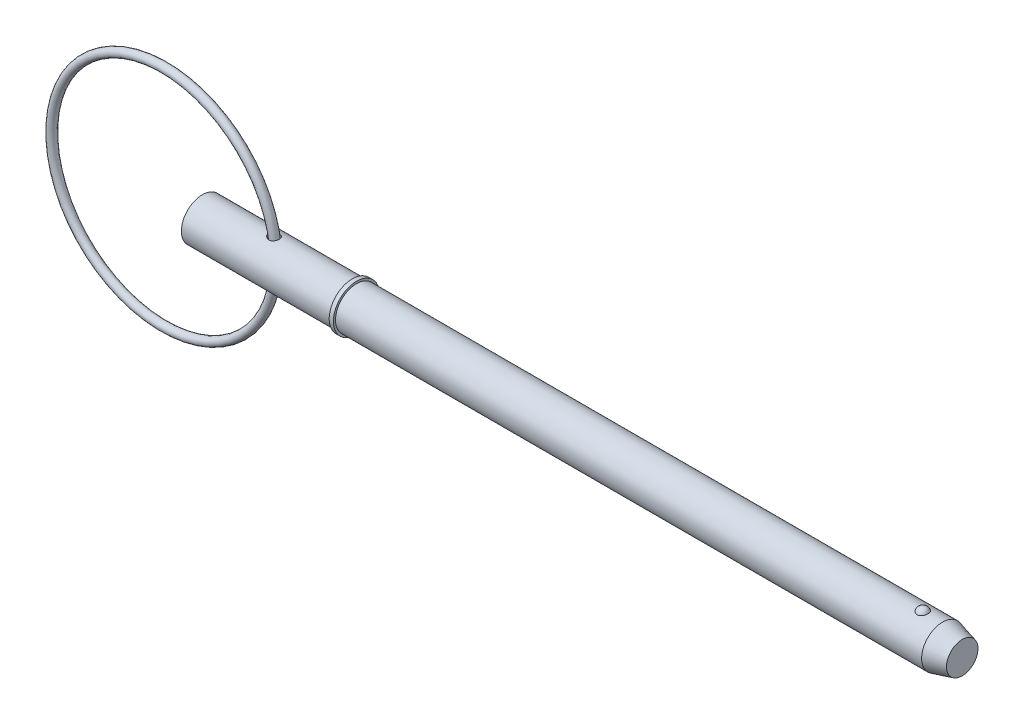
ISO-10303-21;
HEADER;
FILE_DESCRIPTION(('STEP AP214'),'2;1');
FILE_NAME('part.step','',(''),(''),'','','');
FILE_SCHEMA(('AUTOMOTIVE_DESIGN { 1 0 10303 214 1 1 1 1 }'));
ENDSEC;
DATA;
#1=APPLICATION_CONTEXT('core data for automotive mechanical design processes');
#2=APPLICATION_PROTOCOL_DEFINITION('international standard','automotive_design',2000,#1);
#3=PRODUCT_CONTEXT('',#1,'mechanical');
#4=PRODUCT('Part','Part','',(#3));
#5=PRODUCT_RELATED_PRODUCT_CATEGORY('part','',(#4));
#6=PRODUCT_DEFINITION_FORMATION('','',#4);
#7=PRODUCT_DEFINITION_CONTEXT('part definition',#1,'design');
#8=PRODUCT_DEFINITION('design','',#6,#7);
#9=PRODUCT_DEFINITION_SHAPE('','',#8);
#10=(LENGTH_UNIT() NAMED_UNIT(*) SI_UNIT(.MILLI.,.METRE.));
#11=(NAMED_UNIT(*) PLANE_ANGLE_UNIT() SI_UNIT($,.RADIAN.));
#12=(NAMED_UNIT(*) SI_UNIT($,.STERADIAN.) SOLID_ANGLE_UNIT());
#13=UNCERTAINTY_MEASURE_WITH_UNIT(LENGTH_MEASURE(1.E-05),#10,'distance_accuracy_value','');
#14=(GEOMETRIC_REPRESENTATION_CONTEXT(3) GLOBAL_UNCERTAINTY_ASSIGNED_CONTEXT((#13)) GLOBAL_UNIT_ASSIGNED_CONTEXT((#10,
#11,#12)) REPRESENTATION_CONTEXT('',''));
#15=CARTESIAN_POINT('',(0.,0.,0.));
#16=DIRECTION('',(0.,0.,1.));
#17=DIRECTION('',(1.,0.,0.));
#18=AXIS2_PLACEMENT_3D('',#15,#16,#17);
#19=CARTESIAN_POINT('',(-4.3552379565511,0.,0.));
#20=DIRECTION('',(0.,0.,1.));
#21=DIRECTION('',(1.,0.,0.));
#22=AXIS2_PLACEMENT_3D('',#19,#20,#21);
#23=TOROIDAL_SURFACE('',#22,12.7,0.476000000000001);
#24=CARTESIAN_POINT('',(8.8207620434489,0.,0.));
#25=VERTEX_POINT('',#24);
#26=VERTEX_LOOP('',#25);
#27=FACE_BOUND('',#26,.T.);
#28=ADVANCED_FACE('P0_F12',(#27),#23,.T.);
#29=CLOSED_SHELL('',(#28));
#30=MANIFOLD_SOLID_BREP('P0_B1',#29);
#31=CARTESIAN_POINT('',(0.,0.,0.));
#32=DIRECTION('',(1.,0.,0.));
#33=DIRECTION('',(0.,0.,-1.));
#34=AXIS2_PLACEMENT_3D('',#31,#32,#33);
#35=CYLINDRICAL_SURFACE('',#34,2.38);
#36=CARTESIAN_POINT('',(7.65248265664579,2.35074198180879,-0.372037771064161));
#37=CARTESIAN_POINT('',(7.67546616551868,2.34644965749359,-0.399158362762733));
#38=CARTESIAN_POINT('',(7.70081651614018,2.34199234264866,-0.424274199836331));
#39=CARTESIAN_POINT('',(7.75542747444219,2.33326580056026,-0.46990771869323));
#40=CARTESIAN_POINT('',(7.78469342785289,2.32899684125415,-0.49041900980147));
#41=CARTESIAN_POINT('',(7.8462833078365,2.32114904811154,-0.526312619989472));
#42=CARTESIAN_POINT('',(7.87860537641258,2.31756979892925,-0.541698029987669));
#43=CARTESIAN_POINT('',(7.9454452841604,2.31153734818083,-0.566889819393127));
#44=CARTESIAN_POINT('',(7.97996214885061,2.30908365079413,-0.576698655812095));
#45=CARTESIAN_POINT('',(8.05000735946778,2.30564492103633,-0.590297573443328));
#46=CARTESIAN_POINT('',(8.0855275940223,2.30465036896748,-0.594126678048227));
#47=CARTESIAN_POINT('',(8.15670718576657,2.30426876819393,-0.595606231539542));
#48=CARTESIAN_POINT('',(8.1923664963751,2.30488122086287,-0.593258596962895));
#49=CARTESIAN_POINT('',(8.26077822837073,2.30759475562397,-0.582609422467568));
#50=CARTESIAN_POINT('',(8.29358437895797,2.30961492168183,-0.574631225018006));
#51=CARTESIAN_POINT('',(8.35727060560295,2.31483318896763,-0.553233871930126));
#52=CARTESIAN_POINT('',(8.38815097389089,2.31803111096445,-0.53981554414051));
#53=CARTESIAN_POINT('',(8.44618254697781,2.3251225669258,-0.508384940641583));
#54=CARTESIAN_POINT('',(8.47341743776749,2.32899254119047,-0.490521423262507));
#55=CARTESIAN_POINT('',(8.5244826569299,2.33706025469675,-0.450515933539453));
#56=CARTESIAN_POINT('',(8.54831285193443,2.34125800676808,-0.428373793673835));
#57=CARTESIAN_POINT('',(8.5921621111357,2.34956202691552,-0.38020980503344));
#58=CARTESIAN_POINT('',(8.61214543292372,2.35366715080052,-0.354155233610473));
#59=CARTESIAN_POINT('',(8.64754725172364,2.36130301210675,-0.299034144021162));
#60=CARTESIAN_POINT('',(8.66296545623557,2.36483371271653,-0.269967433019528));
#61=CARTESIAN_POINT('',(8.68903776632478,2.37098548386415,-0.209215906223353));
#62=CARTESIAN_POINT('',(8.69962580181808,2.37359383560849,-0.177501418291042));
#63=CARTESIAN_POINT('',(8.71546966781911,2.37755210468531,-0.112692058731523));
#64=CARTESIAN_POINT('',(8.72072552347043,2.37890202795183,-0.0795971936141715));
#65=CARTESIAN_POINT('',(8.72577448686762,2.38019811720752,-0.0129544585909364));
#66=CARTESIAN_POINT('',(8.72556573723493,2.38014380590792,0.0205935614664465));
#67=CARTESIAN_POINT('',(8.71968604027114,2.37863606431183,0.0871753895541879));
#68=CARTESIAN_POINT('',(8.71401506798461,2.37718262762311,0.120209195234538));
#69=CARTESIAN_POINT('',(8.69736472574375,2.37303648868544,0.184779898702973));
#70=CARTESIAN_POINT('',(8.68639268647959,2.37034549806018,0.216318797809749));
#71=CARTESIAN_POINT('',(8.65941400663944,2.36401552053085,0.277063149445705));
#72=CARTESIAN_POINT('',(8.6434071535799,2.36037649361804,0.306268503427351));
#73=CARTESIAN_POINT('',(8.60670627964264,2.35253749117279,0.361595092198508));
#74=CARTESIAN_POINT('',(8.58600040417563,2.34833610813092,0.387708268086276));
#75=CARTESIAN_POINT('',(8.54044852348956,2.33984863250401,0.436017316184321));
#76=CARTESIAN_POINT('',(8.51560272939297,2.33556254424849,0.458213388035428));
#77=CARTESIAN_POINT('',(8.46260111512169,2.32742099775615,0.497916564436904));
#78=CARTESIAN_POINT('',(8.43446763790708,2.32356294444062,0.51545294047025));
#79=CARTESIAN_POINT('',(8.37555109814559,2.31668866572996,0.545520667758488));
#80=CARTESIAN_POINT('',(8.34476845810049,2.31367230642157,0.558052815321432));
#81=CARTESIAN_POINT('',(8.28194930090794,2.30886128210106,0.57763341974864));
#82=CARTESIAN_POINT('',(8.24993988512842,2.30704826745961,0.584764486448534));
#83=CARTESIAN_POINT('',(8.18514558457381,2.30475365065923,0.593744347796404));
#84=CARTESIAN_POINT('',(8.15236068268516,2.30427207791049,0.595593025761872));
#85=CARTESIAN_POINT('',(8.08670515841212,2.30466513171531,0.594069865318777));
#86=CARTESIAN_POINT('',(8.05383545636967,2.30554895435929,0.590662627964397));
#87=CARTESIAN_POINT('',(7.98908593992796,2.30856010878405,0.578780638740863));
#88=CARTESIAN_POINT('',(7.95720636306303,2.31068773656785,0.570304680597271));
#89=CARTESIAN_POINT('',(7.89377258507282,2.31605973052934,0.54809064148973));
#90=CARTESIAN_POINT('',(7.86230095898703,2.31935100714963,0.534128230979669));
#91=CARTESIAN_POINT('',(7.80205133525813,2.32664713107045,0.501391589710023));
#92=CARTESIAN_POINT('',(7.77327429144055,2.33065222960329,0.48261566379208));
#93=CARTESIAN_POINT('',(7.7179634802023,2.3391254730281,0.439760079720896));
#94=CARTESIAN_POINT('',(7.69158313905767,2.3436062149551,0.415484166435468));
#95=CARTESIAN_POINT('',(7.64339516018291,2.35235146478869,0.362706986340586));
#96=CARTESIAN_POINT('',(7.62158727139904,2.35661598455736,0.334205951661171));
#97=CARTESIAN_POINT('',(7.58382605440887,2.36432007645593,0.274368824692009));
#98=CARTESIAN_POINT('',(7.56774982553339,2.36777633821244,0.243112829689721));
#99=CARTESIAN_POINT('',(7.54152169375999,2.3735493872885,0.178112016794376));
#100=CARTESIAN_POINT('',(7.53136536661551,2.3758670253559,0.14436907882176));
#101=CARTESIAN_POINT('',(7.51809691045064,2.37891982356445,0.0783638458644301));
#102=CARTESIAN_POINT('',(7.5144720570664,2.37976992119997,0.0462095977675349));
#103=CARTESIAN_POINT('',(7.51285288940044,2.38014795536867,-0.0182487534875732));
#104=CARTESIAN_POINT('',(7.5148575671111,2.37967612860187,-0.0505528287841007));
#105=CARTESIAN_POINT('',(7.52413867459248,2.37752661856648,-0.112617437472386));
#106=CARTESIAN_POINT('',(7.53113538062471,2.37591295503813,-0.14242285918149));
#107=CARTESIAN_POINT('',(7.5497775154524,2.37172196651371,-0.200451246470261));
#108=CARTESIAN_POINT('',(7.56142049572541,2.3691451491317,-0.228675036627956));
#109=CARTESIAN_POINT('',(7.58571901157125,2.36396321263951,-0.276620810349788));
#110=CARTESIAN_POINT('',(7.59751818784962,2.36150235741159,-0.296799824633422));
#111=CARTESIAN_POINT('',(7.62336661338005,2.35629864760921,-0.33561908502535));
#112=CARTESIAN_POINT('',(7.63741608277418,2.353555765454,-0.354259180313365));
#113=CARTESIAN_POINT('',(7.65248265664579,2.35074198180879,-0.372037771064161));
#114=B_SPLINE_CURVE_WITH_KNOTS('',3,(#36,#37,#38,#39,#40,#41,#42,#43,#44,#45,#46,#47,#48,#49,
#50,#51,#52,#53,#54,#55,#56,#57,#58,#59,#60,#61,#62,#63,#64,#65,#66,#67,#68,#69,#70,#71,#72,#73,
#74,#75,#76,#77,#78,#79,#80,#81,#82,#83,#84,#85,#86,#87,#88,#89,#90,#91,#92,#93,#94,#95,#96,#97,
#98,#99,#100,#101,#102,#103,#104,#105,#106,#107,#108,#109,#110,#111,#112,#113),.UNSPECIFIED.,
.T.,.F.,(4,2,2,2,2,2,2,2,2,2,2,2,2,2,2,2,2,2,2,2,2,2,2,2,2,2,2,2,2,2,2,2,2,2,2,2,2,2,4),(0.,
0.107335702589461,0.214819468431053,0.322238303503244,0.429609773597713,0.536277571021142,
0.642912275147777,0.743874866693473,0.844822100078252,0.942762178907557,1.04070609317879,
1.1395202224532,1.23834068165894,1.33847507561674,1.43860899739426,1.53877695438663,
1.63894536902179,1.73897565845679,1.83901017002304,1.93929990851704,2.03958453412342,
2.13922343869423,2.23884648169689,2.33691317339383,2.4349820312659,2.53371427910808,
2.63247003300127,2.73577311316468,2.83911262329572,2.94697761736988,3.05483668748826,
3.16021984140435,3.26552413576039,3.36212700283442,3.45871257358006,3.55027266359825,
3.64178456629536,3.71214035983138,3.78250304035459),.UNSPECIFIED.);
#115=CARTESIAN_POINT('',(7.65248265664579,2.35074198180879,-0.372037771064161));
#116=VERTEX_POINT('',#115);
#117=EDGE_CURVE('P1_E42',#116,#116,#114,.T.);
#118=ORIENTED_EDGE('',*,*,#117,.T.);
#119=EDGE_LOOP('',(#118));
#120=FACE_BOUND('',#119,.T.);
#121=CARTESIAN_POINT('',(0.,0.,0.));
#122=DIRECTION('',(1.,0.,0.));
#123=DIRECTION('',(0.,0.,-1.));
#124=AXIS2_PLACEMENT_3D('',#121,#122,#123);
#125=CIRCLE('',#124,2.38);
#126=CARTESIAN_POINT('',(0.,0.,-2.38));
#127=VERTEX_POINT('',#126);
#128=EDGE_CURVE('P1_E9',#127,#127,#125,.T.);
#129=ORIENTED_EDGE('',*,*,#128,.T.);
#130=EDGE_LOOP('',(#129));
#131=FACE_BOUND('',#130,.T.);
#132=CARTESIAN_POINT('',(16.974,0.,0.));
#133=DIRECTION('',(1.,0.,0.));
#134=DIRECTION('',(0.,0.,-1.));
#135=AXIS2_PLACEMENT_3D('',#132,#133,#134);
#136=CIRCLE('',#135,2.38);
#137=CARTESIAN_POINT('',(16.974,0.,-2.38));
#138=VERTEX_POINT('',#137);
#139=EDGE_CURVE('P1_E25',#138,#138,#136,.T.);
#140=ORIENTED_EDGE('',*,*,#139,.F.);
#141=EDGE_LOOP('',(#140));
#142=FACE_BOUND('',#141,.T.);
#143=CARTESIAN_POINT('',(7.65248265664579,-2.35074198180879,-0.372037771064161));
#144=CARTESIAN_POINT('',(7.63152023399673,-2.35465684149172,-0.347300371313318));
#145=CARTESIAN_POINT('',(7.61251328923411,-2.35843676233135,-0.320880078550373));
#146=CARTESIAN_POINT('',(7.57904107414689,-2.36534227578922,-0.265218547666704));
#147=CARTESIAN_POINT('',(7.56457485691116,-2.36846800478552,-0.235977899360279));
#148=CARTESIAN_POINT('',(7.54072865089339,-2.37373250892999,-0.175281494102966));
#149=CARTESIAN_POINT('',(7.53136565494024,-2.37586798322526,-0.143818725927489));
#150=CARTESIAN_POINT('',(7.51825775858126,-2.37888184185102,-0.0796854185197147));
#151=CARTESIAN_POINT('',(7.51451093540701,-2.37976065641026,-0.0470152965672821));
#152=CARTESIAN_POINT('',(7.51287230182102,-2.38014359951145,0.0167788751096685));
#153=CARTESIAN_POINT('',(7.51468714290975,-2.37971660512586,0.0478953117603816));
#154=CARTESIAN_POINT('',(7.52344977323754,-2.37768530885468,0.109352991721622));
#155=CARTESIAN_POINT('',(7.53039746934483,-2.37608102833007,0.139694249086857));
#156=CARTESIAN_POINT('',(7.54900783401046,-2.37189301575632,0.198451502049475));
#157=CARTESIAN_POINT('',(7.56061918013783,-2.36931996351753,0.226884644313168));
#158=CARTESIAN_POINT('',(7.58810377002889,-2.36345094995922,0.281524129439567));
#159=CARTESIAN_POINT('',(7.60397804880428,-2.36015481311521,0.307729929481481));
#160=CARTESIAN_POINT('',(7.64062367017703,-2.35291979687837,0.359001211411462));
#161=CARTESIAN_POINT('',(7.66164499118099,-2.34895316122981,0.383883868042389));
#162=CARTESIAN_POINT('',(7.70730875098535,-2.34094029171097,0.430056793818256));
#163=CARTESIAN_POINT('',(7.73195270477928,-2.33689402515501,0.451345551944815));
#164=CARTESIAN_POINT('',(7.78628123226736,-2.32880869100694,0.491427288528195));
#165=CARTESIAN_POINT('',(7.81620889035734,-2.32479472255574,0.509896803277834));
#166=CARTESIAN_POINT('',(7.87876464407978,-2.31758417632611,0.541729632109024));
#167=CARTESIAN_POINT('',(7.91139323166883,-2.31438774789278,0.55509201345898));
#168=CARTESIAN_POINT('',(7.97916670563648,-2.30915137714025,0.576493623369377));
#169=CARTESIAN_POINT('',(8.0143485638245,-2.30713552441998,0.584422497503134));
#170=CARTESIAN_POINT('',(8.08560438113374,-2.30465258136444,0.594140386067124));
#171=CARTESIAN_POINT('',(8.12167802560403,-2.30418495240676,0.595931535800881));
#172=CARTESIAN_POINT('',(8.19193481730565,-2.30488473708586,0.59321801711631));
#173=CARTESIAN_POINT('',(8.2261295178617,-2.30597897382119,0.588995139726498));
#174=CARTESIAN_POINT('',(8.29321509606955,-2.30956729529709,0.574762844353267));
#175=CARTESIAN_POINT('',(8.32610629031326,-2.31206103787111,0.564754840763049));
#176=CARTESIAN_POINT('',(8.38816900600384,-2.31802118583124,0.539753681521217));
#177=CARTESIAN_POINT('',(8.41743993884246,-2.32144077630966,0.52499526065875));
#178=CARTESIAN_POINT('',(8.47302365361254,-2.32890801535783,0.490807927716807));
#179=CARTESIAN_POINT('',(8.49933643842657,-2.33295566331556,0.471379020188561));
#180=CARTESIAN_POINT('',(8.54827790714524,-2.3412242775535,0.428422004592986));
#181=CARTESIAN_POINT('',(8.57091094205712,-2.34544503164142,0.40489880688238));
#182=CARTESIAN_POINT('',(8.61197038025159,-2.35360640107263,0.354387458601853));
#183=CARTESIAN_POINT('',(8.63039647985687,-2.35754699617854,0.32739905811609));
#184=CARTESIAN_POINT('',(8.66284943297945,-2.36478461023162,0.270249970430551));
#185=CARTESIAN_POINT('',(8.67680333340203,-2.36807065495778,0.240046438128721));
#186=CARTESIAN_POINT('',(8.69957181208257,-2.37356560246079,0.177668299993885));
#187=CARTESIAN_POINT('',(8.70838630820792,-2.37577448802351,0.14549366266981));
#188=CARTESIAN_POINT('',(8.72068442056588,-2.37888446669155,0.0799353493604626));
#189=CARTESIAN_POINT('',(8.72414498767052,-2.37977990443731,0.046547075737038));
#190=CARTESIAN_POINT('',(8.72557509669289,-2.38014803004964,-0.0203543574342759));
#191=CARTESIAN_POINT('',(8.72354468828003,-2.37962073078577,-0.0538675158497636));
#192=CARTESIAN_POINT('',(8.71405606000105,-2.37720346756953,-0.119981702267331));
#193=CARTESIAN_POINT('',(8.70661109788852,-2.37531683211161,-0.152584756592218));
#194=CARTESIAN_POINT('',(8.68649336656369,-2.37038779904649,-0.216044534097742));
#195=CARTESIAN_POINT('',(8.67382040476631,-2.36734535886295,-0.24690119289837));
#196=CARTESIAN_POINT('',(8.64352750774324,-2.36042700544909,-0.306062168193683));
#197=CARTESIAN_POINT('',(8.62589743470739,-2.35654938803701,-0.334361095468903));
#198=CARTESIAN_POINT('',(8.58613860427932,-2.34839114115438,-0.387535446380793));
#199=CARTESIAN_POINT('',(8.5640098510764,-2.34411051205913,-0.412410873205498));
#200=CARTESIAN_POINT('',(8.51586484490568,-2.33563475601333,-0.457982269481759));
#201=CARTESIAN_POINT('',(8.48985596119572,-2.33143948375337,-0.478685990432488));
#202=CARTESIAN_POINT('',(8.43462330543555,-2.32360655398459,-0.515369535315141));
#203=CARTESIAN_POINT('',(8.40540000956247,-2.31996881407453,-0.531350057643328));
#204=CARTESIAN_POINT('',(8.34502624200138,-2.31371771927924,-0.557938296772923));
#205=CARTESIAN_POINT('',(8.31391082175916,-2.31108995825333,-0.568622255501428));
#206=CARTESIAN_POINT('',(8.25027207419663,-2.30707117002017,-0.584715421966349));
#207=CARTESIAN_POINT('',(8.21774884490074,-2.30568005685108,-0.590124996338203));
#208=CARTESIAN_POINT('',(8.15238918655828,-2.30427145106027,-0.595601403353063));
#209=CARTESIAN_POINT('',(8.11955499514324,-2.3042474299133,-0.595693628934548));
#210=CARTESIAN_POINT('',(8.05430726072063,-2.30552664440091,-0.590722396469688));
#211=CARTESIAN_POINT('',(8.02189380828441,-2.3068301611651,-0.585657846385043));
#212=CARTESIAN_POINT('',(7.95720150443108,-2.31066076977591,-0.570360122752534));
#213=CARTESIAN_POINT('',(7.92496602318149,-2.31322859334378,-0.55995436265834));
#214=CARTESIAN_POINT('',(7.86260707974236,-2.31930140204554,-0.534242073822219));
#215=CARTESIAN_POINT('',(7.83248403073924,-2.32280656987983,-0.518934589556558));
#216=CARTESIAN_POINT('',(7.77533132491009,-2.33034138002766,-0.483968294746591));
#217=CARTESIAN_POINT('',(7.74827623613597,-2.33436601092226,-0.464349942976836));
#218=CARTESIAN_POINT('',(7.69762060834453,-2.34255524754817,-0.4210920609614));
#219=CARTESIAN_POINT('',(7.67401956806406,-2.34671983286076,-0.397453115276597));
#220=CARTESIAN_POINT('',(7.65248265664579,-2.35074198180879,-0.372037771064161));
#221=B_SPLINE_CURVE_WITH_KNOTS('',3,(#143,#144,#145,#146,#147,#148,#149,#150,#151,#152,#153,
#154,#155,#156,#157,#158,#159,#160,#161,#162,#163,#164,#165,#166,#167,#168,#169,#170,#171,#172,
#173,#174,#175,#176,#177,#178,#179,#180,#181,#182,#183,#184,#185,#186,#187,#188,#189,#190,#191,
#192,#193,#194,#195,#196,#197,#198,#199,#200,#201,#202,#203,#204,#205,#206,#207,#208,#209,#210,
#211,#212,#213,#214,#215,#216,#217,#218,#219,#220),.UNSPECIFIED.,.T.,.F.,(4,2,2,2,2,2,2,2,2,2,2,
2,2,2,2,2,2,2,2,2,2,2,2,2,2,2,2,2,2,2,2,2,2,2,2,2,2,2,4),(0.,0.0978755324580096,
0.19573064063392,0.293909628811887,0.39205499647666,0.48511441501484,0.578172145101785,
0.670232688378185,0.762315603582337,0.860342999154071,0.958411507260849,1.06411708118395,
1.16984195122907,1.27765506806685,1.38543067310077,1.48831936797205,1.59118291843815,
1.68959047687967,1.78799793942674,1.88628818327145,1.98458551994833,2.08441314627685,
2.18424236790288,2.28450017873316,2.38475708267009,2.48476932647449,2.58478525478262,
2.68500723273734,2.78522911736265,2.88526302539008,2.98528213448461,3.08381637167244,
3.18234375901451,3.28040059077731,3.37847819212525,3.4799455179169,3.58143263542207,
3.68200512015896,3.78256299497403),.UNSPECIFIED.);
#222=CARTESIAN_POINT('',(7.65248265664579,-2.35074198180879,-0.372037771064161));
#223=VERTEX_POINT('',#222);
#224=EDGE_CURVE('P1_E17',#223,#223,#221,.T.);
#225=ORIENTED_EDGE('',*,*,#224,.T.);
#226=EDGE_LOOP('',(#225));
#227=FACE_BOUND('',#226,.T.);
#228=ADVANCED_FACE('P1_F13',(#120,#131,#142,#227),#35,.T.);
#229=CARTESIAN_POINT('',(0.,0.,0.));
#230=DIRECTION('',(1.,0.,0.));
#231=DIRECTION('',(0.,0.,-1.));
#232=AXIS2_PLACEMENT_3D('',#229,#230,#231);
#233=CYLINDRICAL_SURFACE('',#232,2.38);
#234=CARTESIAN_POINT('',(83.8094297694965,0.,0.));
#235=DIRECTION('',(1.,0.,0.));
#236=DIRECTION('',(0.,0.,-1.));
#237=AXIS2_PLACEMENT_3D('',#234,#235,#236);
#238=CIRCLE('',#237,2.38);
#239=CARTESIAN_POINT('',(83.8094297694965,0.,-2.38));
#240=VERTEX_POINT('',#239);
#241=EDGE_CURVE('P1_E99',#240,#240,#238,.T.);
#242=ORIENTED_EDGE('',*,*,#241,.F.);
#243=EDGE_LOOP('',(#242));
#244=FACE_BOUND('',#243,.T.);
#245=CARTESIAN_POINT('',(17.45,0.,0.));
#246=DIRECTION('',(1.,0.,0.));
#247=DIRECTION('',(0.,0.,-1.));
#248=AXIS2_PLACEMENT_3D('',#245,#246,#247);
#249=CIRCLE('',#248,2.38);
#250=CARTESIAN_POINT('',(17.45,0.,-2.38));
#251=VERTEX_POINT('',#250);
#252=EDGE_CURVE('P1_E96',#251,#251,#249,.T.);
#253=ORIENTED_EDGE('',*,*,#252,.T.);
#254=EDGE_LOOP('',(#253));
#255=FACE_BOUND('',#254,.T.);
#256=CARTESIAN_POINT('',(81.5634492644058,2.2921568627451,0.64063789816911));
#257=CARTESIAN_POINT('',(81.5303559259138,2.29215737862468,0.640637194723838));
#258=CARTESIAN_POINT('',(81.4972546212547,2.29293179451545,0.63788468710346));
#259=CARTESIAN_POINT('',(81.4320176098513,2.29594030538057,0.62696820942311));
#260=CARTESIAN_POINT('',(81.3998823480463,2.29817506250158,0.618801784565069));
#261=CARTESIAN_POINT('',(81.3375402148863,2.3038430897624,0.597351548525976));
#262=CARTESIAN_POINT('',(81.3073305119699,2.30727454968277,0.584075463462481));
#263=CARTESIAN_POINT('',(81.2495674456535,2.31495941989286,0.552829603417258));
#264=CARTESIAN_POINT('',(81.2220141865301,2.31921286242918,0.534859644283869));
#265=CARTESIAN_POINT('',(81.1695938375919,2.32820213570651,0.494282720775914));
#266=CARTESIAN_POINT('',(81.1448050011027,2.33294694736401,0.471576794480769));
#267=CARTESIAN_POINT('',(81.0992169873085,2.34234144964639,0.422446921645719));
#268=CARTESIAN_POINT('',(81.0784185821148,2.34699112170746,0.396022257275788));
#269=CARTESIAN_POINT('',(81.0403580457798,2.35593942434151,0.338855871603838));
#270=CARTESIAN_POINT('',(81.0233051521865,2.36021170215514,0.307970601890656));
#271=CARTESIAN_POINT('',(80.9943607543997,2.3677057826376,0.243750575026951));
#272=CARTESIAN_POINT('',(80.9824701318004,2.37092740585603,0.21041540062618));
#273=CARTESIAN_POINT('',(80.9638076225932,2.37606901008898,0.141189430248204));
#274=CARTESIAN_POINT('',(80.9571956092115,2.37794816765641,0.105252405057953));
#275=CARTESIAN_POINT('',(80.9498095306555,2.38005135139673,0.0327351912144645));
#276=CARTESIAN_POINT('',(80.9490358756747,2.38027526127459,-0.00384504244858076));
#277=CARTESIAN_POINT('',(80.9533628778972,2.37903842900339,-0.0769838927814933));
#278=CARTESIAN_POINT('',(80.9585202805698,2.37756141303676,-0.113538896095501));
#279=CARTESIAN_POINT('',(80.9747013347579,2.37305303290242,-0.185229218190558));
#280=CARTESIAN_POINT('',(80.9857251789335,2.37002161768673,-0.220364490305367));
#281=CARTESIAN_POINT('',(81.0133977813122,2.36273722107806,-0.288156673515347));
#282=CARTESIAN_POINT('',(81.0300389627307,2.35848588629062,-0.320816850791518));
#283=CARTESIAN_POINT('',(81.0685984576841,2.34923130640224,-0.38274468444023));
#284=CARTESIAN_POINT('',(81.090516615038,2.34422808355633,-0.412012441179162));
#285=CARTESIAN_POINT('',(81.1387549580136,2.33412555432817,-0.465830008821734));
#286=CARTESIAN_POINT('',(81.1650028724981,2.32902887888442,-0.490444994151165));
#287=CARTESIAN_POINT('',(81.2214769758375,2.31926941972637,-0.534700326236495));
#288=CARTESIAN_POINT('',(81.251702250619,2.3146065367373,-0.554341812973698));
#289=CARTESIAN_POINT('',(81.3140618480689,2.30645675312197,-0.58731242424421));
#290=CARTESIAN_POINT('',(81.3460780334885,2.30293152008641,-0.600855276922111));
#291=CARTESIAN_POINT('',(81.4120795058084,2.29725171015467,-0.622220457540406));
#292=CARTESIAN_POINT('',(81.4460641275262,2.29509667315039,-0.630044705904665));
#293=CARTESIAN_POINT('',(81.513299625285,2.29249264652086,-0.639452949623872));
#294=CARTESIAN_POINT('',(81.5465087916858,2.29196755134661,-0.641315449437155));
#295=CARTESIAN_POINT('',(81.612763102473,2.29246849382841,-0.639522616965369));
#296=CARTESIAN_POINT('',(81.6458082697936,2.29349430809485,-0.635868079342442));
#297=CARTESIAN_POINT('',(81.7101025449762,2.29694059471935,-0.623301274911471));
#298=CARTESIAN_POINT('',(81.7413744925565,2.29933234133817,-0.61449721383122));
#299=CARTESIAN_POINT('',(81.8019952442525,2.30522511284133,-0.592006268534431));
#300=CARTESIAN_POINT('',(81.8313438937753,2.30872622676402,-0.578318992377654));
#301=CARTESIAN_POINT('',(81.8880369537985,2.31655795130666,-0.546112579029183));
#302=CARTESIAN_POINT('',(81.915320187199,2.32090569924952,-0.527490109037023));
#303=CARTESIAN_POINT('',(81.9664904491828,2.3299220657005,-0.486117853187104));
#304=CARTESIAN_POINT('',(81.9903767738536,2.33459075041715,-0.463367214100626));
#305=CARTESIAN_POINT('',(82.0352722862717,2.34399834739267,-0.413220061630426));
#306=CARTESIAN_POINT('',(82.0560972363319,2.34873051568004,-0.385657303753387));
#307=CARTESIAN_POINT('',(82.093056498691,2.35754932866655,-0.327455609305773));
#308=CARTESIAN_POINT('',(82.1091898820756,2.36163584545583,-0.296816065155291));
#309=CARTESIAN_POINT('',(82.1369822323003,2.36889321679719,-0.232047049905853));
#310=CARTESIAN_POINT('',(82.1484450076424,2.37202275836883,-0.197828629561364));
#311=CARTESIAN_POINT('',(82.1657523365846,2.37681926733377,-0.127900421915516));
#312=CARTESIAN_POINT('',(82.1715962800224,2.37848607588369,-0.0921904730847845));
#313=CARTESIAN_POINT('',(82.177605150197,2.38020024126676,-0.0196348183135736));
#314=CARTESIAN_POINT('',(82.1776704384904,2.38021918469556,0.0172198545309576));
#315=CARTESIAN_POINT('',(82.1718689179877,2.37856356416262,0.0904219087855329));
#316=CARTESIAN_POINT('',(82.1660018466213,2.37688892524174,0.126769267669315));
#317=CARTESIAN_POINT('',(82.148425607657,2.37201688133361,0.198028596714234));
#318=CARTESIAN_POINT('',(82.1366998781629,2.36881516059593,0.232936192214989));
#319=CARTESIAN_POINT('',(82.1076354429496,2.36123444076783,0.300196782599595));
#320=CARTESIAN_POINT('',(82.0902967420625,2.3568554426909,0.332549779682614));
#321=CARTESIAN_POINT('',(82.0505350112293,2.34744667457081,0.393495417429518));
#322=CARTESIAN_POINT('',(82.0281528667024,2.34242227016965,0.422115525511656));
#323=CARTESIAN_POINT('',(81.9787391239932,2.33227293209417,0.475004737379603));
#324=CARTESIAN_POINT('',(81.9517076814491,2.32714800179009,0.499273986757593));
#325=CARTESIAN_POINT('',(81.8944988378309,2.31755359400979,0.542046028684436));
#326=CARTESIAN_POINT('',(81.8644297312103,2.3130698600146,0.56069032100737));
#327=CARTESIAN_POINT('',(81.8013869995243,2.3051412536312,0.592447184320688));
#328=CARTESIAN_POINT('',(81.7684158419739,2.30169550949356,0.605564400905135));
#329=CARTESIAN_POINT('',(81.7068424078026,2.29677744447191,0.623927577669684));
#330=CARTESIAN_POINT('',(81.6785555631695,2.29505839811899,0.630178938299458));
#331=CARTESIAN_POINT('',(81.6213308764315,2.29274795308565,0.638534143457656));
#332=CARTESIAN_POINT('',(81.5923931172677,2.29215641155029,0.640638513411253));
#333=CARTESIAN_POINT('',(81.5634492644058,2.2921568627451,0.64063789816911));
#334=B_SPLINE_CURVE_WITH_KNOTS('',3,(#256,#257,#258,#259,#260,#261,#262,#263,#264,#265,#266,
#267,#268,#269,#270,#271,#272,#273,#274,#275,#276,#277,#278,#279,#280,#281,#282,#283,#284,#285,
#286,#287,#288,#289,#290,#291,#292,#293,#294,#295,#296,#297,#298,#299,#300,#301,#302,#303,#304,
#305,#306,#307,#308,#309,#310,#311,#312,#313,#314,#315,#316,#317,#318,#319,#320,#321,#322,#323,
#324,#325,#326,#327,#328,#329,#330,#331,#332,#333),.UNSPECIFIED.,.T.,.F.,(4,2,2,2,2,2,2,2,2,2,2,
2,2,2,2,2,2,2,2,2,2,2,2,2,2,2,2,2,2,2,2,2,2,2,2,2,2,2,4),(0.,0.0991724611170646,
0.198389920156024,0.297457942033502,0.396529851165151,0.497927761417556,0.599345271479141,
0.705475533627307,0.811623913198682,0.920876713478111,1.03013718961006,1.14045177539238,
1.25076998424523,1.36093998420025,1.47110672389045,1.57959248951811,1.68805336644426,
1.79234266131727,1.89659691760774,1.99590391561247,2.09519661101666,2.19247425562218,
2.28975970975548,2.38926978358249,2.48880044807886,2.59293588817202,2.69709193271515,
2.80525821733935,2.91343624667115,3.02347917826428,3.13352698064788,3.24388765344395,
3.35424823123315,3.46374443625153,3.57323697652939,3.67968690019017,3.78604717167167,
3.87279565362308,3.95953314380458),.UNSPECIFIED.);
#335=CARTESIAN_POINT('',(81.5634492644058,2.2921568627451,0.64063789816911));
#336=VERTEX_POINT('',#335);
#337=EDGE_CURVE('P1_E34',#336,#336,#334,.T.);
#338=ORIENTED_EDGE('',*,*,#337,.T.);
#339=EDGE_LOOP('',(#338));
#340=FACE_BOUND('',#339,.T.);
#341=ADVANCED_FACE('P1_F46',(#244,#255,#340),#233,.T.);
#342=CARTESIAN_POINT('',(0.,0.,0.));
#343=DIRECTION('',(-1.,0.,0.));
#344=DIRECTION('',(0.,0.,1.));
#345=AXIS2_PLACEMENT_3D('',#342,#343,#344);
#346=PLANE('',#345);
#347=ORIENTED_EDGE('',*,*,#128,.F.);
#348=EDGE_LOOP('',(#347));
#349=FACE_BOUND('',#348,.T.);
#350=ADVANCED_FACE('P1_F15',(#349),#346,.T.);
#351=CARTESIAN_POINT('',(16.974,2.38,0.));
#352=DIRECTION('',(-1.,0.,0.));
#353=DIRECTION('',(0.,0.,1.));
#354=AXIS2_PLACEMENT_3D('',#351,#352,#353);
#355=PLANE('',#354);
#356=ORIENTED_EDGE('',*,*,#139,.T.);
#357=EDGE_LOOP('',(#356));
#358=FACE_BOUND('',#357,.T.);
#359=CARTESIAN_POINT('',(16.974,0.,0.));
#360=DIRECTION('',(1.,0.,0.));
#361=DIRECTION('',(0.,0.,-1.));
#362=AXIS2_PLACEMENT_3D('',#359,#360,#361);
#363=CIRCLE('',#362,2.618);
#364=CARTESIAN_POINT('',(16.974,0.,-2.618));
#365=VERTEX_POINT('',#364);
#366=EDGE_CURVE('P1_E30',#365,#365,#363,.T.);
#367=ORIENTED_EDGE('',*,*,#366,.F.);
#368=EDGE_LOOP('',(#367));
#369=FACE_BOUND('',#368,.T.);
#370=ADVANCED_FACE('P1_F81',(#358,#369),#355,.T.);
#371=CARTESIAN_POINT('',(0.,0.,0.));
#372=DIRECTION('',(1.,0.,0.));
#373=DIRECTION('',(0.,0.,-1.));
#374=AXIS2_PLACEMENT_3D('',#371,#372,#373);
#375=CYLINDRICAL_SURFACE('',#374,2.618);
#376=ORIENTED_EDGE('',*,*,#366,.T.);
#377=EDGE_LOOP('',(#376));
#378=FACE_BOUND('',#377,.T.);
#379=CARTESIAN_POINT('',(17.45,0.,0.));
#380=DIRECTION('',(1.,0.,0.));
#381=DIRECTION('',(0.,0.,-1.));
#382=AXIS2_PLACEMENT_3D('',#379,#380,#381);
#383=CIRCLE('',#382,2.618);
#384=CARTESIAN_POINT('',(17.45,0.,-2.618));
#385=VERTEX_POINT('',#384);
#386=EDGE_CURVE('P1_E95',#385,#385,#383,.T.);
#387=ORIENTED_EDGE('',*,*,#386,.F.);
#388=EDGE_LOOP('',(#387));
#389=FACE_BOUND('',#388,.T.);
#390=ADVANCED_FACE('P1_F68',(#378,#389),#375,.T.);
#391=CARTESIAN_POINT('',(17.45,2.618,0.));
#392=DIRECTION('',(1.,0.,0.));
#393=DIRECTION('',(0.,0.,-1.));
#394=AXIS2_PLACEMENT_3D('',#391,#392,#393);
#395=PLANE('',#394);
#396=ORIENTED_EDGE('',*,*,#386,.T.);
#397=EDGE_LOOP('',(#396));
#398=FACE_BOUND('',#397,.T.);
#399=ORIENTED_EDGE('',*,*,#252,.F.);
#400=EDGE_LOOP('',(#399));
#401=FACE_BOUND('',#400,.T.);
#402=ADVANCED_FACE('P1_F62',(#398,#401),#395,.T.);
#403=CARTESIAN_POINT('',(86.03,0.,0.));
#404=DIRECTION('',(-1.,0.,0.));
#405=DIRECTION('',(0.,0.,1.));
#406=AXIS2_PLACEMENT_3D('',#403,#404,#405);
#407=CONICAL_SURFACE('',#406,1.78500000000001,0.261799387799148);
#408=ORIENTED_EDGE('',*,*,#241,.T.);
#409=EDGE_LOOP('',(#408));
#410=FACE_BOUND('',#409,.T.);
#411=CARTESIAN_POINT('',(86.03,0.,0.));
#412=DIRECTION('',(1.,0.,0.));
#413=DIRECTION('',(0.,0.,-1.));
#414=AXIS2_PLACEMENT_3D('',#411,#412,#413);
#415=CIRCLE('',#414,1.78500000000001);
#416=CARTESIAN_POINT('',(86.03,0.,-1.78500000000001));
#417=VERTEX_POINT('',#416);
#418=EDGE_CURVE('P1_E41',#417,#417,#415,.T.);
#419=ORIENTED_EDGE('',*,*,#418,.F.);
#420=EDGE_LOOP('',(#419));
#421=FACE_BOUND('',#420,.T.);
#422=ADVANCED_FACE('P1_F59',(#410,#421),#407,.T.);
#423=CARTESIAN_POINT('',(86.03,1.78500000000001,0.));
#424=DIRECTION('',(1.,0.,0.));
#425=DIRECTION('',(0.,0.,-1.));
#426=AXIS2_PLACEMENT_3D('',#423,#424,#425);
#427=PLANE('',#426);
#428=ORIENTED_EDGE('',*,*,#418,.T.);
#429=EDGE_LOOP('',(#428));
#430=FACE_BOUND('',#429,.T.);
#431=ADVANCED_FACE('P1_F55',(#430),#427,.T.);
#432=CARTESIAN_POINT('',(81.5634492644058,2.14199999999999,0.));
#433=DIRECTION('',(-1.,0.,0.));
#434=DIRECTION('',(0.,-1.,0.));
#435=AXIS2_PLACEMENT_3D('',#432,#433,#434);
#436=SPHERICAL_SURFACE('',#435,0.657999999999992);
#437=ORIENTED_EDGE('',*,*,#337,.F.);
#438=EDGE_LOOP('',(#437));
#439=FACE_BOUND('',#438,.T.);
#440=ADVANCED_FACE('P1_F50',(#439),#436,.T.);
#441=CARTESIAN_POINT('',(-4.3552379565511,0.,0.));
#442=DIRECTION('',(0.,0.,1.));
#443=DIRECTION('',(1.,0.,0.));
#444=AXIS2_PLACEMENT_3D('',#441,#442,#443);
#445=TOROIDAL_SURFACE('',#444,12.7,0.594999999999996);
#446=ORIENTED_EDGE('',*,*,#224,.F.);
#447=EDGE_LOOP('',(#446));
#448=FACE_BOUND('',#447,.T.);
#449=ORIENTED_EDGE('',*,*,#117,.F.);
#450=EDGE_LOOP('',(#449));
#451=FACE_BOUND('',#450,.T.);
#452=ADVANCED_FACE('P1_F54',(#448,#451),#445,.F.);
#453=CLOSED_SHELL('',(#228,#341,#350,#370,#390,#402,#422,#431,#440,#452));
#454=MANIFOLD_SOLID_BREP('P1_B1',#453);
#455=ADVANCED_BREP_SHAPE_REPRESENTATION('',(#18,#30,#454),#14);
#456=SHAPE_DEFINITION_REPRESENTATION(#9,#455);
ENDSEC;
END-ISO-10303-21;
